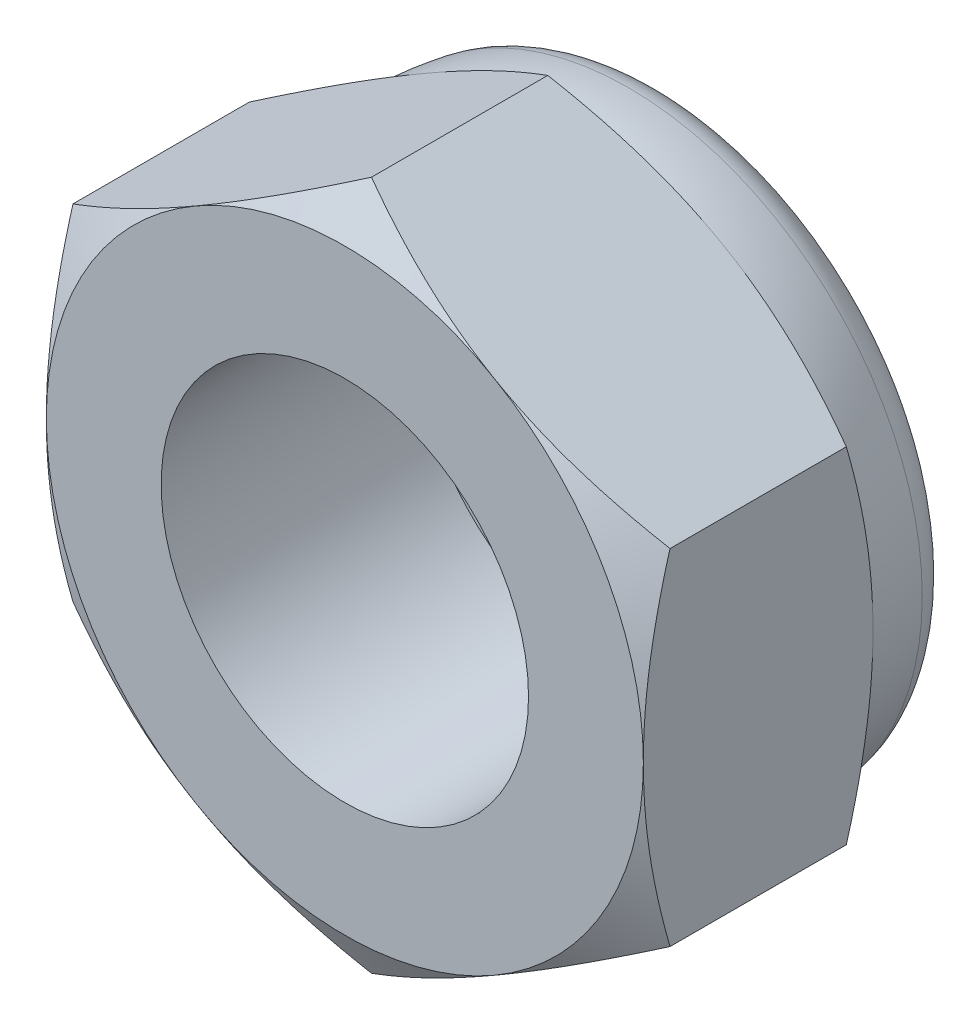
ISO-10303-21;
HEADER;
FILE_DESCRIPTION(('STEP AP214'),'2;1');
FILE_NAME('part.step','',(''),(''),'','','');
FILE_SCHEMA(('AUTOMOTIVE_DESIGN { 1 0 10303 214 1 1 1 1 }'));
ENDSEC;
DATA;
#1=APPLICATION_CONTEXT('core data for automotive mechanical design processes');
#2=APPLICATION_PROTOCOL_DEFINITION('international standard','automotive_design',2000,#1);
#3=PRODUCT_CONTEXT('',#1,'mechanical');
#4=PRODUCT('Part','Part','',(#3));
#5=PRODUCT_RELATED_PRODUCT_CATEGORY('part','',(#4));
#6=PRODUCT_DEFINITION_FORMATION('','',#4);
#7=PRODUCT_DEFINITION_CONTEXT('part definition',#1,'design');
#8=PRODUCT_DEFINITION('design','',#6,#7);
#9=PRODUCT_DEFINITION_SHAPE('','',#8);
#10=(LENGTH_UNIT() NAMED_UNIT(*) SI_UNIT(.MILLI.,.METRE.));
#11=(NAMED_UNIT(*) PLANE_ANGLE_UNIT() SI_UNIT($,.RADIAN.));
#12=(NAMED_UNIT(*) SI_UNIT($,.STERADIAN.) SOLID_ANGLE_UNIT());
#13=UNCERTAINTY_MEASURE_WITH_UNIT(LENGTH_MEASURE(1.E-05),#10,'distance_accuracy_value','');
#14=(GEOMETRIC_REPRESENTATION_CONTEXT(3) GLOBAL_UNCERTAINTY_ASSIGNED_CONTEXT((#13)) GLOBAL_UNIT_ASSIGNED_CONTEXT((#10,
#11,#12)) REPRESENTATION_CONTEXT('',''));
#15=CARTESIAN_POINT('',(0.,0.,0.));
#16=DIRECTION('',(0.,0.,1.));
#17=DIRECTION('',(1.,0.,0.));
#18=AXIS2_PLACEMENT_3D('',#15,#16,#17);
#19=CARTESIAN_POINT('',(0.,0.,-7.));
#20=DIRECTION('',(0.,0.,1.));
#21=DIRECTION('',(1.,0.,0.));
#22=AXIS2_PLACEMENT_3D('',#19,#20,#21);
#23=CYLINDRICAL_SURFACE('',#22,4.);
#24=CARTESIAN_POINT('',(0.,0.,0.));
#25=DIRECTION('',(0.,0.,1.));
#26=DIRECTION('',(1.,0.,0.));
#27=AXIS2_PLACEMENT_3D('',#24,#25,#26);
#28=CIRCLE('',#27,4.);
#29=CARTESIAN_POINT('',(4.,0.,0.));
#30=VERTEX_POINT('',#29);
#31=EDGE_CURVE('E165',#30,#30,#28,.T.);
#32=ORIENTED_EDGE('',*,*,#31,.T.);
#33=EDGE_LOOP('',(#32));
#34=FACE_BOUND('',#33,.T.);
#35=CARTESIAN_POINT('',(0.,0.,-5.6));
#36=DIRECTION('',(0.,0.,-1.));
#37=DIRECTION('',(-1.,0.,0.));
#38=AXIS2_PLACEMENT_3D('',#35,#36,#37);
#39=CIRCLE('',#38,4.);
#40=CARTESIAN_POINT('',(-4.,0.,-5.6));
#41=VERTEX_POINT('',#40);
#42=EDGE_CURVE('E11',#41,#41,#39,.F.);
#43=ORIENTED_EDGE('',*,*,#42,.F.);
#44=EDGE_LOOP('',(#43));
#45=FACE_BOUND('',#44,.T.);
#46=ADVANCED_FACE('F38',(#34,#45),#23,.F.);
#47=CARTESIAN_POINT('',(-6.5,11.2583302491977,0.));
#48=DIRECTION('',(0.,0.,-1.));
#49=DIRECTION('',(-1.,0.,0.));
#50=AXIS2_PLACEMENT_3D('',#47,#48,#49);
#51=PLANE('',#50);
#52=ORIENTED_EDGE('',*,*,#31,.F.);
#53=EDGE_LOOP('',(#52));
#54=FACE_BOUND('',#53,.T.);
#55=CARTESIAN_POINT('',(0.,0.,0.));
#56=DIRECTION('',(0.,0.,-1.));
#57=DIRECTION('',(-1.,0.,0.));
#58=AXIS2_PLACEMENT_3D('',#55,#56,#57);
#59=CIRCLE('',#58,6.5);
#60=CARTESIAN_POINT('',(-6.5,0.,0.));
#61=VERTEX_POINT('',#60);
#62=CARTESIAN_POINT('',(-3.25,5.62916512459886,0.));
#63=VERTEX_POINT('',#62);
#64=EDGE_CURVE('E164',#61,#63,#59,.T.);
#65=ORIENTED_EDGE('',*,*,#64,.F.);
#66=CARTESIAN_POINT('',(0.,0.,0.));
#67=DIRECTION('',(0.,0.,-1.));
#68=DIRECTION('',(-1.,0.,0.));
#69=AXIS2_PLACEMENT_3D('',#66,#67,#68);
#70=CIRCLE('',#69,6.5);
#71=CARTESIAN_POINT('',(-3.25,-5.62916512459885,0.));
#72=VERTEX_POINT('',#71);
#73=EDGE_CURVE('E152',#61,#72,#70,.F.);
#74=ORIENTED_EDGE('',*,*,#73,.T.);
#75=CARTESIAN_POINT('',(3.25,-5.62916512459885,0.));
#76=VERTEX_POINT('',#75);
#77=EDGE_CURVE('E279',#72,#76,#70,.F.);
#78=ORIENTED_EDGE('',*,*,#77,.T.);
#79=CARTESIAN_POINT('',(6.5,0.,0.));
#80=VERTEX_POINT('',#79);
#81=EDGE_CURVE('E577',#76,#80,#70,.F.);
#82=ORIENTED_EDGE('',*,*,#81,.T.);
#83=CARTESIAN_POINT('',(3.25,5.62916512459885,0.));
#84=VERTEX_POINT('',#83);
#85=EDGE_CURVE('E576',#80,#84,#70,.F.);
#86=ORIENTED_EDGE('',*,*,#85,.T.);
#87=EDGE_CURVE('E265',#84,#63,#70,.F.);
#88=ORIENTED_EDGE('',*,*,#87,.T.);
#89=EDGE_LOOP('',(#65,#74,#78,#82,#86,#88));
#90=FACE_BOUND('',#89,.T.);
#91=ADVANCED_FACE('F196',(#54,#90),#51,.F.);
#92=CARTESIAN_POINT('',(0.,0.,0.));
#93=DIRECTION('',(0.,0.,-1.));
#94=DIRECTION('',(-1.,0.,0.));
#95=AXIS2_PLACEMENT_3D('',#92,#93,#94);
#96=CONICAL_SURFACE('',#95,6.5,1.0471975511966);
#97=CARTESIAN_POINT('',(-6.5,-10.2216195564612,-3.24082762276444));
#98=CARTESIAN_POINT('',(-6.5,-9.93651394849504,-3.10196402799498));
#99=CARTESIAN_POINT('',(-6.5,-9.65076884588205,-2.96439164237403));
#100=CARTESIAN_POINT('',(-6.5,-9.07766011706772,-2.69255273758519));
#101=CARTESIAN_POINT('',(-6.5,-8.79029625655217,-2.55828671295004));
#102=CARTESIAN_POINT('',(-6.5,-8.21219637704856,-2.29313832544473));
#103=CARTESIAN_POINT('',(-6.5,-7.92145059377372,-2.16227718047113));
#104=CARTESIAN_POINT('',(-6.5,-7.33769549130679,-1.90572451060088));
#105=CARTESIAN_POINT('',(-6.5,-7.04468627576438,-1.78003275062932));
#106=CARTESIAN_POINT('',(-6.5,-6.44593854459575,-1.53101993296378));
#107=CARTESIAN_POINT('',(-6.5,-6.14010572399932,-1.40792443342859));
#108=CARTESIAN_POINT('',(-6.5,-5.52491418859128,-1.17071249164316));
#109=CARTESIAN_POINT('',(-6.5,-5.2155550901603,-1.05659703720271));
#110=CARTESIAN_POINT('',(-6.5,-4.59335490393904,-0.840237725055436));
#111=CARTESIAN_POINT('',(-6.5,-4.28052184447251,-0.737971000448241));
#112=CARTESIAN_POINT('',(-6.5,-3.65036651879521,-0.548498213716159));
#113=CARTESIAN_POINT('',(-6.5,-3.33304565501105,-0.461287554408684));
#114=CARTESIAN_POINT('',(-6.5,-2.69554853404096,-0.306488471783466));
#115=CARTESIAN_POINT('',(-6.5,-2.37539989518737,-0.238788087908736));
#116=CARTESIAN_POINT('',(-6.5,-1.73093127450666,-0.126743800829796));
#117=CARTESIAN_POINT('',(-6.5,-1.40661173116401,-0.0823974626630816));
#118=CARTESIAN_POINT('',(-6.5,-0.920458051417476,-0.0363312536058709));
#119=CARTESIAN_POINT('',(-6.5,-0.759553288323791,-0.0243981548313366));
#120=CARTESIAN_POINT('',(-6.5,-0.437375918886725,-0.00734758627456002));
#121=CARTESIAN_POINT('',(-6.5,-0.27610331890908,-0.0022299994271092));
#122=CARTESIAN_POINT('',(-6.5,0.0465118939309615,0.0010595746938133));
#123=CARTESIAN_POINT('',(-6.5,0.207854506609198,-0.000768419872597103));
#124=CARTESIAN_POINT('',(-6.5,0.530316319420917,-0.0113216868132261));
#125=CARTESIAN_POINT('',(-6.5,0.691435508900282,-0.020047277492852));
#126=CARTESIAN_POINT('',(-6.5,1.07446143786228,-0.0488019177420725));
#127=CARTESIAN_POINT('',(-6.5,1.29614515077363,-0.0718705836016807));
#128=CARTESIAN_POINT('',(-6.5,1.73794833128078,-0.129839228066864));
#129=CARTESIAN_POINT('',(-6.5,1.95806759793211,-0.164740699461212));
#130=CARTESIAN_POINT('',(-6.5,2.61578223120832,-0.285350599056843));
#131=CARTESIAN_POINT('',(-6.5,3.05050755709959,-0.386945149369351));
#132=CARTESIAN_POINT('',(-6.5,3.70072032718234,-0.564152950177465));
#133=CARTESIAN_POINT('',(-6.5,3.91955235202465,-0.628209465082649));
#134=CARTESIAN_POINT('',(-6.5,4.35509395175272,-0.763235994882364));
#135=CARTESIAN_POINT('',(-6.5,4.5718035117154,-0.834206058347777));
#136=CARTESIAN_POINT('',(-6.5,5.00316322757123,-0.981899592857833));
#137=CARTESIAN_POINT('',(-6.5,5.21781397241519,-1.05862135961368));
#138=CARTESIAN_POINT('',(-6.5,5.64531984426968,-1.21688977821));
#139=CARTESIAN_POINT('',(-6.5,5.85817499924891,-1.2984363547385));
#140=CARTESIAN_POINT('',(-6.5,6.38550742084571,-1.50623164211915));
#141=CARTESIAN_POINT('',(-6.5,6.69902199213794,-1.63491982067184));
#142=CARTESIAN_POINT('',(-6.5,7.32314965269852,-1.89917186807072));
#143=CARTESIAN_POINT('',(-6.5,7.63376250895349,-2.03473628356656));
#144=CARTESIAN_POINT('',(-6.5,8.252670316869,-2.31127478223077));
#145=CARTESIAN_POINT('',(-6.5,8.56096457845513,-2.45225040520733));
#146=CARTESIAN_POINT('',(-6.5,9.17556027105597,-2.73844637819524));
#147=CARTESIAN_POINT('',(-6.5,9.48186175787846,-2.88366660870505));
#148=CARTESIAN_POINT('',(-6.5,10.0932253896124,-3.177700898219));
#149=CARTESIAN_POINT('',(-6.5,10.398285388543,-3.32651941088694));
#150=CARTESIAN_POINT('',(-6.5,11.0070399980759,-3.62692607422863));
#151=CARTESIAN_POINT('',(-6.5,11.3107345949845,-3.77851425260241));
#152=CARTESIAN_POINT('',(-6.5,12.2200136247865,-4.23660374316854));
#153=CARTESIAN_POINT('',(-6.5,12.8238971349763,-4.5464804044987));
#154=CARTESIAN_POINT('',(-6.5,13.9729832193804,-5.14362568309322));
#155=CARTESIAN_POINT('',(-6.5,14.518470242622,-5.43034952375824));
#156=CARTESIAN_POINT('',(-6.5,15.6074489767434,-6.00761837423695));
#157=CARTESIAN_POINT('',(-6.5,16.1509405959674,-6.29816355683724));
#158=CARTESIAN_POINT('',(-6.5,17.2348021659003,-6.88128411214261));
#159=CARTESIAN_POINT('',(-6.5,17.7751765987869,-7.17385116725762));
#160=CARTESIAN_POINT('',(-6.5,18.8546634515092,-7.76122204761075));
#161=CARTESIAN_POINT('',(-6.5,19.393775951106,-8.056025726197));
#162=CARTESIAN_POINT('',(-6.5,19.9324319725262,-8.35165555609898));
#163=B_SPLINE_CURVE_WITH_KNOTS('',3,(#97,#98,#99,#100,#101,#102,#103,#104,#105,#106,#107,#108,
#109,#110,#111,#112,#113,#114,#115,#116,#117,#118,#119,#120,#121,#122,#123,#124,#125,#126,#127,
#128,#129,#130,#131,#132,#133,#134,#135,#136,#137,#138,#139,#140,#141,#142,#143,#144,#145,#146,
#147,#148,#149,#150,#151,#152,#153,#154,#155,#156,#157,#158,#159,#160,#161,#162),.UNSPECIFIED.,
.F.,.F.,(4,2,2,2,2,2,2,2,2,2,2,2,2,2,2,2,2,2,2,2,2,2,2,2,2,2,2,2,2,2,2,2,4),(0.,
0.951386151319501,1.90291374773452,2.85938775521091,3.81581821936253,4.8047370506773,
5.79376451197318,6.78085027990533,7.76763411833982,8.74863704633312,9.72953767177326,
10.2134552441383,10.6973645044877,11.1812724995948,11.6652028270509,12.3334704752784,
13.0018224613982,14.3392064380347,15.0231895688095,15.7071775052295,16.3909635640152,
17.0747389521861,18.091318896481,19.1079797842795,20.1249321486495,21.141855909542,
22.1601102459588,23.1783747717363,25.2145576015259,27.0632980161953,28.9121223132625,
30.7555917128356,32.5989412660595),.UNSPECIFIED.);
#164=CARTESIAN_POINT('',(-6.5,3.75277674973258,-0.580556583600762));
#165=VERTEX_POINT('',#164);
#166=EDGE_CURVE('E182',#165,#61,#163,.F.);
#167=ORIENTED_EDGE('',*,*,#166,.T.);
#168=ORIENTED_EDGE('',*,*,#64,.T.);
#169=CARTESIAN_POINT('',(0.0002,7.50566896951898,-0.580623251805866));
#170=CARTESIAN_POINT('',(-0.14267745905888,7.4231786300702,-0.533004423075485));
#171=CARTESIAN_POINT('',(-0.286087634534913,7.34038072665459,-0.487546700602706));
#172=CARTESIAN_POINT('',(-0.574072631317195,7.17411251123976,-0.401548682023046));
#173=CARTESIAN_POINT('',(-0.718647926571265,7.09064192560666,-0.361010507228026));
#174=CARTESIAN_POINT('',(-1.15468865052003,6.83889369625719,-0.247571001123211));
#175=CARTESIAN_POINT('',(-1.44787528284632,6.66962231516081,-0.183047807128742));
#176=CARTESIAN_POINT('',(-1.88662374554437,6.41631077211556,-0.107386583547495));
#177=CARTESIAN_POINT('',(-2.03087463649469,6.33302748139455,-0.0858328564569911));
#178=CARTESIAN_POINT('',(-2.32002821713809,6.16608458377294,-0.0496903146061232));
#179=CARTESIAN_POINT('',(-2.46493084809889,6.08242501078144,-0.035100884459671));
#180=CARTESIAN_POINT('',(-2.75498777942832,5.91496056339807,-0.0132587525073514));
#181=CARTESIAN_POINT('',(-2.90014160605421,5.83115596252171,-0.00599772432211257));
#182=CARTESIAN_POINT('',(-3.19057533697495,5.66347396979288,0.00103969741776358));
#183=CARTESIAN_POINT('',(-3.33585523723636,5.57959658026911,0.000816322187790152));
#184=CARTESIAN_POINT('',(-3.73387594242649,5.34979921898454,-0.0100834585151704));
#185=CARTESIAN_POINT('',(-3.98648646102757,5.20395446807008,-0.0283818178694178));
#186=CARTESIAN_POINT('',(-4.49002967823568,4.91323365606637,-0.0864063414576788));
#187=CARTESIAN_POINT('',(-4.74096060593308,4.76835861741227,-0.126152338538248));
#188=CARTESIAN_POINT('',(-5.24551722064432,4.47705272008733,-0.225505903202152));
#189=CARTESIAN_POINT('',(-5.49907924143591,4.33065861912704,-0.285534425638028));
#190=CARTESIAN_POINT('',(-6.00242193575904,4.04005357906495,-0.421774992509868));
#191=CARTESIAN_POINT('',(-6.25220905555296,3.89583891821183,-0.497955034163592));
#192=CARTESIAN_POINT('',(-6.5002,3.75266127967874,-0.580623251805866));
#193=B_SPLINE_CURVE_WITH_KNOTS('',3,(#169,#170,#171,#172,#173,#174,#175,#176,#177,#178,#179,
#180,#181,#182,#183,#184,#185,#186,#187,#188,#189,#190,#191,#192),.UNSPECIFIED.,.F.,.F.,(4,2,2,
2,2,2,2,2,2,2,2,4),(0.,0.515105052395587,1.03043143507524,2.06322554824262,2.56697389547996,
3.07067772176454,3.57380860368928,4.0769239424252,4.9527935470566,5.82947446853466,
6.72559912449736,7.61996451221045),.UNSPECIFIED.);
#194=EDGE_CURVE('E168',#63,#165,#193,.T.);
#195=ORIENTED_EDGE('',*,*,#194,.T.);
#196=EDGE_LOOP('',(#167,#168,#195));
#197=FACE_BOUND('',#196,.T.);
#198=ADVANCED_FACE('F190',(#197),#96,.T.);
#199=CARTESIAN_POINT('',(6.5002,3.75266127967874,-0.580623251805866));
#200=CARTESIAN_POINT('',(6.35732254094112,3.83515161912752,-0.533004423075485));
#201=CARTESIAN_POINT('',(6.21391236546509,3.91794952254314,-0.487546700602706));
#202=CARTESIAN_POINT('',(5.9259273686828,4.08421773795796,-0.401548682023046));
#203=CARTESIAN_POINT('',(5.78135207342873,4.16768832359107,-0.361010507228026));
#204=CARTESIAN_POINT('',(5.34531134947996,4.41943655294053,-0.247571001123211));
#205=CARTESIAN_POINT('',(5.05212471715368,4.58870793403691,-0.183047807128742));
#206=CARTESIAN_POINT('',(4.61337625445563,4.84201947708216,-0.107386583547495));
#207=CARTESIAN_POINT('',(4.46912536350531,4.92530276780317,-0.085832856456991));
#208=CARTESIAN_POINT('',(4.17997178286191,5.09224566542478,-0.0496903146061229));
#209=CARTESIAN_POINT('',(4.03506915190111,5.17590523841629,-0.0351008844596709));
#210=CARTESIAN_POINT('',(3.74501222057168,5.34336968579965,-0.0132587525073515));
#211=CARTESIAN_POINT('',(3.59985839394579,5.42717428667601,-0.00599772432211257));
#212=CARTESIAN_POINT('',(3.30942466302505,5.59485627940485,0.00103969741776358));
#213=CARTESIAN_POINT('',(3.16414476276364,5.67873366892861,0.000816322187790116));
#214=CARTESIAN_POINT('',(2.7661240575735,5.90853103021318,-0.0100834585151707));
#215=CARTESIAN_POINT('',(2.51351353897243,6.05437578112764,-0.0283818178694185));
#216=CARTESIAN_POINT('',(2.00997032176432,6.34509659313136,-0.0864063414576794));
#217=CARTESIAN_POINT('',(1.75903939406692,6.48997163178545,-0.126152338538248));
#218=CARTESIAN_POINT('',(1.25448277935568,6.78127752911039,-0.225505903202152));
#219=CARTESIAN_POINT('',(1.00092075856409,6.92767163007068,-0.285534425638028));
#220=CARTESIAN_POINT('',(0.497578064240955,7.21827667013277,-0.421774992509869));
#221=CARTESIAN_POINT('',(0.247790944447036,7.36249133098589,-0.497955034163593));
#222=CARTESIAN_POINT('',(-0.0001999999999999,7.50566896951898,-0.580623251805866));
#223=B_SPLINE_CURVE_WITH_KNOTS('',3,(#199,#200,#201,#202,#203,#204,#205,#206,#207,#208,#209,
#210,#211,#212,#213,#214,#215,#216,#217,#218,#219,#220,#221,#222),.UNSPECIFIED.,.F.,.F.,(4,2,2,
2,2,2,2,2,2,2,2,4),(0.,0.515105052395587,1.03043143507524,2.06322554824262,2.56697389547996,
3.07067772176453,3.57380860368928,4.0769239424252,4.9527935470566,5.82947446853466,
6.72559912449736,7.61996451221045),.UNSPECIFIED.);
#224=CARTESIAN_POINT('',(0.,7.50555349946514,-0.580556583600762));
#225=VERTEX_POINT('',#224);
#226=EDGE_CURVE('E208',#84,#225,#223,.T.);
#227=ORIENTED_EDGE('',*,*,#226,.T.);
#228=EDGE_CURVE('E181',#225,#63,#193,.T.);
#229=ORIENTED_EDGE('',*,*,#228,.T.);
#230=ORIENTED_EDGE('',*,*,#87,.F.);
#231=EDGE_LOOP('',(#227,#229,#230));
#232=FACE_BOUND('',#231,.T.);
#233=ADVANCED_FACE('F195',(#232),#96,.T.);
#234=CARTESIAN_POINT('',(6.5,-10.2216195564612,-3.24082762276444));
#235=CARTESIAN_POINT('',(6.5,-9.93651394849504,-3.10196402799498));
#236=CARTESIAN_POINT('',(6.5,-9.65076884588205,-2.96439164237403));
#237=CARTESIAN_POINT('',(6.5,-9.07766011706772,-2.69255273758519));
#238=CARTESIAN_POINT('',(6.5,-8.79029625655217,-2.55828671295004));
#239=CARTESIAN_POINT('',(6.5,-8.21219637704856,-2.29313832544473));
#240=CARTESIAN_POINT('',(6.5,-7.92145059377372,-2.16227718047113));
#241=CARTESIAN_POINT('',(6.5,-7.33769549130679,-1.90572451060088));
#242=CARTESIAN_POINT('',(6.5,-7.04468627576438,-1.78003275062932));
#243=CARTESIAN_POINT('',(6.5,-6.44593854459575,-1.53101993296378));
#244=CARTESIAN_POINT('',(6.5,-6.14010572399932,-1.40792443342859));
#245=CARTESIAN_POINT('',(6.5,-5.52491418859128,-1.17071249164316));
#246=CARTESIAN_POINT('',(6.5,-5.2155550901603,-1.05659703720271));
#247=CARTESIAN_POINT('',(6.5,-4.59335490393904,-0.840237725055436));
#248=CARTESIAN_POINT('',(6.5,-4.28052184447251,-0.737971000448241));
#249=CARTESIAN_POINT('',(6.5,-3.65036651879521,-0.548498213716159));
#250=CARTESIAN_POINT('',(6.5,-3.33304565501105,-0.461287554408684));
#251=CARTESIAN_POINT('',(6.5,-2.69554853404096,-0.306488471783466));
#252=CARTESIAN_POINT('',(6.5,-2.37539989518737,-0.238788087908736));
#253=CARTESIAN_POINT('',(6.5,-1.73093127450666,-0.126743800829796));
#254=CARTESIAN_POINT('',(6.5,-1.40661173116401,-0.0823974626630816));
#255=CARTESIAN_POINT('',(6.5,-0.920458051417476,-0.0363312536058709));
#256=CARTESIAN_POINT('',(6.5,-0.759553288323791,-0.0243981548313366));
#257=CARTESIAN_POINT('',(6.5,-0.437375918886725,-0.00734758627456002));
#258=CARTESIAN_POINT('',(6.5,-0.27610331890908,-0.0022299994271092));
#259=CARTESIAN_POINT('',(6.5,0.0465118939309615,0.0010595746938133));
#260=CARTESIAN_POINT('',(6.5,0.207854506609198,-0.000768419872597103));
#261=CARTESIAN_POINT('',(6.5,0.530316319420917,-0.0113216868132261));
#262=CARTESIAN_POINT('',(6.5,0.691435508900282,-0.020047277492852));
#263=CARTESIAN_POINT('',(6.5,1.07446143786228,-0.0488019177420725));
#264=CARTESIAN_POINT('',(6.5,1.29614515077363,-0.0718705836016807));
#265=CARTESIAN_POINT('',(6.5,1.73794833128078,-0.129839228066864));
#266=CARTESIAN_POINT('',(6.5,1.95806759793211,-0.164740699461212));
#267=CARTESIAN_POINT('',(6.5,2.61578223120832,-0.285350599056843));
#268=CARTESIAN_POINT('',(6.5,3.05050755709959,-0.386945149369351));
#269=CARTESIAN_POINT('',(6.5,3.70072032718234,-0.564152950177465));
#270=CARTESIAN_POINT('',(6.5,3.91955235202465,-0.628209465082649));
#271=CARTESIAN_POINT('',(6.5,4.35509395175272,-0.763235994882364));
#272=CARTESIAN_POINT('',(6.5,4.5718035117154,-0.834206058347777));
#273=CARTESIAN_POINT('',(6.5,5.00316322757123,-0.981899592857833));
#274=CARTESIAN_POINT('',(6.5,5.21781397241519,-1.05862135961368));
#275=CARTESIAN_POINT('',(6.5,5.64531984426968,-1.21688977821));
#276=CARTESIAN_POINT('',(6.5,5.85817499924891,-1.2984363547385));
#277=CARTESIAN_POINT('',(6.5,6.38550742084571,-1.50623164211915));
#278=CARTESIAN_POINT('',(6.5,6.69902199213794,-1.63491982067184));
#279=CARTESIAN_POINT('',(6.5,7.32314965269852,-1.89917186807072));
#280=CARTESIAN_POINT('',(6.5,7.63376250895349,-2.03473628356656));
#281=CARTESIAN_POINT('',(6.5,8.252670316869,-2.31127478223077));
#282=CARTESIAN_POINT('',(6.5,8.56096457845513,-2.45225040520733));
#283=CARTESIAN_POINT('',(6.5,9.17556027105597,-2.73844637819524));
#284=CARTESIAN_POINT('',(6.5,9.48186175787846,-2.88366660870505));
#285=CARTESIAN_POINT('',(6.5,10.0932253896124,-3.177700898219));
#286=CARTESIAN_POINT('',(6.5,10.398285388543,-3.32651941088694));
#287=CARTESIAN_POINT('',(6.5,11.0070399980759,-3.62692607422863));
#288=CARTESIAN_POINT('',(6.5,11.3107345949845,-3.77851425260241));
#289=CARTESIAN_POINT('',(6.5,12.2200136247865,-4.23660374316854));
#290=CARTESIAN_POINT('',(6.5,12.8238971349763,-4.5464804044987));
#291=CARTESIAN_POINT('',(6.5,13.9729832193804,-5.14362568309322));
#292=CARTESIAN_POINT('',(6.5,14.518470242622,-5.43034952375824));
#293=CARTESIAN_POINT('',(6.5,15.6074489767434,-6.00761837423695));
#294=CARTESIAN_POINT('',(6.5,16.1509405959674,-6.29816355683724));
#295=CARTESIAN_POINT('',(6.5,17.2348021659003,-6.88128411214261));
#296=CARTESIAN_POINT('',(6.5,17.7751765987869,-7.17385116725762));
#297=CARTESIAN_POINT('',(6.5,18.8546634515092,-7.76122204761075));
#298=CARTESIAN_POINT('',(6.5,19.393775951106,-8.056025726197));
#299=CARTESIAN_POINT('',(6.5,19.9324319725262,-8.35165555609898));
#300=B_SPLINE_CURVE_WITH_KNOTS('',3,(#234,#235,#236,#237,#238,#239,#240,#241,#242,#243,#244,
#245,#246,#247,#248,#249,#250,#251,#252,#253,#254,#255,#256,#257,#258,#259,#260,#261,#262,#263,
#264,#265,#266,#267,#268,#269,#270,#271,#272,#273,#274,#275,#276,#277,#278,#279,#280,#281,#282,
#283,#284,#285,#286,#287,#288,#289,#290,#291,#292,#293,#294,#295,#296,#297,#298,#299),
.UNSPECIFIED.,.F.,.F.,(4,2,2,2,2,2,2,2,2,2,2,2,2,2,2,2,2,2,2,2,2,2,2,2,2,2,2,2,2,2,2,2,4),(0.,
0.951386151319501,1.90291374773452,2.85938775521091,3.81581821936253,4.8047370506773,
5.79376451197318,6.78085027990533,7.76763411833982,8.74863704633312,9.72953767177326,
10.2134552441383,10.6973645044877,11.1812724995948,11.6652028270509,12.3334704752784,
13.0018224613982,14.3392064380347,15.0231895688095,15.7071775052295,16.3909635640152,
17.0747389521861,18.091318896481,19.1079797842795,20.1249321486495,21.141855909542,
22.1601102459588,23.1783747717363,25.2145576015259,27.0632980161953,28.9121223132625,
30.7555917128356,32.5989412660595),.UNSPECIFIED.);
#301=CARTESIAN_POINT('',(6.5,3.75277674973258,-0.580556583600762));
#302=VERTEX_POINT('',#301);
#303=EDGE_CURVE('E221',#80,#302,#300,.T.);
#304=ORIENTED_EDGE('',*,*,#303,.T.);
#305=EDGE_CURVE('E543',#302,#84,#223,.T.);
#306=ORIENTED_EDGE('',*,*,#305,.T.);
#307=ORIENTED_EDGE('',*,*,#85,.F.);
#308=EDGE_LOOP('',(#304,#306,#307));
#309=FACE_BOUND('',#308,.T.);
#310=ADVANCED_FACE('F406',(#309),#96,.T.);
#311=CARTESIAN_POINT('',(-0.0002,-7.50566896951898,-0.580623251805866));
#312=CARTESIAN_POINT('',(0.14267745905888,-7.4231786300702,-0.533004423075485));
#313=CARTESIAN_POINT('',(0.286087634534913,-7.34038072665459,-0.487546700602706));
#314=CARTESIAN_POINT('',(0.574072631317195,-7.17411251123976,-0.401548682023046));
#315=CARTESIAN_POINT('',(0.718647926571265,-7.09064192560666,-0.361010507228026));
#316=CARTESIAN_POINT('',(1.15468865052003,-6.83889369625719,-0.247571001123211));
#317=CARTESIAN_POINT('',(1.44787528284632,-6.66962231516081,-0.183047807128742));
#318=CARTESIAN_POINT('',(1.88662374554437,-6.41631077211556,-0.107386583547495));
#319=CARTESIAN_POINT('',(2.03087463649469,-6.33302748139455,-0.0858328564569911));
#320=CARTESIAN_POINT('',(2.32002821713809,-6.16608458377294,-0.0496903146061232));
#321=CARTESIAN_POINT('',(2.46493084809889,-6.08242501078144,-0.035100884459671));
#322=CARTESIAN_POINT('',(2.75498777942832,-5.91496056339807,-0.0132587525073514));
#323=CARTESIAN_POINT('',(2.90014160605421,-5.83115596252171,-0.00599772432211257));
#324=CARTESIAN_POINT('',(3.19057533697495,-5.66347396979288,0.00103969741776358));
#325=CARTESIAN_POINT('',(3.33585523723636,-5.57959658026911,0.000816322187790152));
#326=CARTESIAN_POINT('',(3.73387594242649,-5.34979921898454,-0.0100834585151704));
#327=CARTESIAN_POINT('',(3.98648646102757,-5.20395446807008,-0.0283818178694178));
#328=CARTESIAN_POINT('',(4.49002967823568,-4.91323365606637,-0.0864063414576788));
#329=CARTESIAN_POINT('',(4.74096060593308,-4.76835861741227,-0.126152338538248));
#330=CARTESIAN_POINT('',(5.24551722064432,-4.47705272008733,-0.225505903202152));
#331=CARTESIAN_POINT('',(5.49907924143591,-4.33065861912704,-0.285534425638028));
#332=CARTESIAN_POINT('',(6.00242193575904,-4.04005357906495,-0.421774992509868));
#333=CARTESIAN_POINT('',(6.25220905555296,-3.89583891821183,-0.497955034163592));
#334=CARTESIAN_POINT('',(6.5002,-3.75266127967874,-0.580623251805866));
#335=B_SPLINE_CURVE_WITH_KNOTS('',3,(#311,#312,#313,#314,#315,#316,#317,#318,#319,#320,#321,
#322,#323,#324,#325,#326,#327,#328,#329,#330,#331,#332,#333,#334),.UNSPECIFIED.,.F.,.F.,(4,2,2,
2,2,2,2,2,2,2,2,4),(0.,0.515105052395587,1.03043143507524,2.06322554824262,2.56697389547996,
3.07067772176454,3.57380860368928,4.0769239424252,4.9527935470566,5.82947446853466,
6.72559912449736,7.61996451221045),.UNSPECIFIED.);
#336=CARTESIAN_POINT('',(6.5,-3.75277674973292,-0.580556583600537));
#337=VERTEX_POINT('',#336);
#338=EDGE_CURVE('E228',#76,#337,#335,.T.);
#339=ORIENTED_EDGE('',*,*,#338,.T.);
#340=EDGE_CURVE('E227',#337,#80,#300,.T.);
#341=ORIENTED_EDGE('',*,*,#340,.T.);
#342=ORIENTED_EDGE('',*,*,#81,.F.);
#343=EDGE_LOOP('',(#339,#341,#342));
#344=FACE_BOUND('',#343,.T.);
#345=ADVANCED_FACE('F414',(#344),#96,.T.);
#346=CARTESIAN_POINT('',(0.,-7.50555349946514,-0.580556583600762));
#347=VERTEX_POINT('',#346);
#348=EDGE_CURVE('E141',#347,#76,#335,.T.);
#349=ORIENTED_EDGE('',*,*,#348,.T.);
#350=ORIENTED_EDGE('',*,*,#77,.F.);
#351=CARTESIAN_POINT('',(-6.5002,-3.75266127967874,-0.580623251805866));
#352=CARTESIAN_POINT('',(-6.35732254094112,-3.83515161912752,-0.533004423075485));
#353=CARTESIAN_POINT('',(-6.21391236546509,-3.91794952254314,-0.487546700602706));
#354=CARTESIAN_POINT('',(-5.9259273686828,-4.08421773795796,-0.401548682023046));
#355=CARTESIAN_POINT('',(-5.78135207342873,-4.16768832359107,-0.361010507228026));
#356=CARTESIAN_POINT('',(-5.34531134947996,-4.41943655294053,-0.247571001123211));
#357=CARTESIAN_POINT('',(-5.05212471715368,-4.58870793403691,-0.183047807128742));
#358=CARTESIAN_POINT('',(-4.61337625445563,-4.84201947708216,-0.107386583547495));
#359=CARTESIAN_POINT('',(-4.46912536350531,-4.92530276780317,-0.085832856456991));
#360=CARTESIAN_POINT('',(-4.17997178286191,-5.09224566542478,-0.0496903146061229));
#361=CARTESIAN_POINT('',(-4.03506915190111,-5.17590523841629,-0.0351008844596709));
#362=CARTESIAN_POINT('',(-3.74501222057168,-5.34336968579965,-0.0132587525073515));
#363=CARTESIAN_POINT('',(-3.59985839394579,-5.42717428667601,-0.00599772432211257));
#364=CARTESIAN_POINT('',(-3.30942466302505,-5.59485627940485,0.00103969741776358));
#365=CARTESIAN_POINT('',(-3.16414476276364,-5.67873366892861,0.000816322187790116));
#366=CARTESIAN_POINT('',(-2.7661240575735,-5.90853103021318,-0.0100834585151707));
#367=CARTESIAN_POINT('',(-2.51351353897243,-6.05437578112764,-0.0283818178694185));
#368=CARTESIAN_POINT('',(-2.00997032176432,-6.34509659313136,-0.0864063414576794));
#369=CARTESIAN_POINT('',(-1.75903939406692,-6.48997163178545,-0.126152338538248));
#370=CARTESIAN_POINT('',(-1.25448277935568,-6.78127752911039,-0.225505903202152));
#371=CARTESIAN_POINT('',(-1.00092075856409,-6.92767163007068,-0.285534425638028));
#372=CARTESIAN_POINT('',(-0.497578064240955,-7.21827667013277,-0.421774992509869));
#373=CARTESIAN_POINT('',(-0.247790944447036,-7.36249133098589,-0.497955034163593));
#374=CARTESIAN_POINT('',(0.0001999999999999,-7.50566896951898,-0.580623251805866));
#375=B_SPLINE_CURVE_WITH_KNOTS('',3,(#351,#352,#353,#354,#355,#356,#357,#358,#359,#360,#361,
#362,#363,#364,#365,#366,#367,#368,#369,#370,#371,#372,#373,#374),.UNSPECIFIED.,.F.,.F.,(4,2,2,
2,2,2,2,2,2,2,2,4),(0.,0.515105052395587,1.03043143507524,2.06322554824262,2.56697389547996,
3.07067772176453,3.57380860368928,4.0769239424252,4.9527935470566,5.82947446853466,
6.72559912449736,7.61996451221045),.UNSPECIFIED.);
#376=EDGE_CURVE('E539',#72,#347,#375,.T.);
#377=ORIENTED_EDGE('',*,*,#376,.T.);
#378=EDGE_LOOP('',(#349,#350,#377));
#379=FACE_BOUND('',#378,.T.);
#380=ADVANCED_FACE('F198',(#379),#96,.T.);
#381=CARTESIAN_POINT('',(-6.5,-3.75277674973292,-0.580556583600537));
#382=VERTEX_POINT('',#381);
#383=EDGE_CURVE('E214',#382,#72,#375,.T.);
#384=ORIENTED_EDGE('',*,*,#383,.T.);
#385=ORIENTED_EDGE('',*,*,#73,.F.);
#386=EDGE_CURVE('E541',#61,#382,#163,.F.);
#387=ORIENTED_EDGE('',*,*,#386,.T.);
#388=EDGE_LOOP('',(#384,#385,#387));
#389=FACE_BOUND('',#388,.T.);
#390=ADVANCED_FACE('F408',(#389),#96,.T.);
#391=CARTESIAN_POINT('',(6.5,3.75277674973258,-5.));
#392=DIRECTION('',(0.499999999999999,0.866025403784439,0.));
#393=DIRECTION('',(-0.866025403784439,0.499999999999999,0.));
#394=AXIS2_PLACEMENT_3D('',#391,#392,#393);
#395=PLANE('',#394);
#396=CARTESIAN_POINT('',(-0.0002,7.50566896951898,-4.41937674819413));
#397=CARTESIAN_POINT('',(0.14267745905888,7.4231786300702,-4.46699557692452));
#398=CARTESIAN_POINT('',(0.286087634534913,7.34038072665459,-4.51245329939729));
#399=CARTESIAN_POINT('',(0.574072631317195,7.17411251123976,-4.59845131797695));
#400=CARTESIAN_POINT('',(0.718647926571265,7.09064192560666,-4.63898949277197));
#401=CARTESIAN_POINT('',(1.15468865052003,6.83889369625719,-4.75242899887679));
#402=CARTESIAN_POINT('',(1.44787528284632,6.66962231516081,-4.81695219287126));
#403=CARTESIAN_POINT('',(1.88662374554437,6.41631077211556,-4.89261341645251));
#404=CARTESIAN_POINT('',(2.03087463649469,6.33302748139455,-4.91416714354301));
#405=CARTESIAN_POINT('',(2.32002821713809,6.16608458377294,-4.95030968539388));
#406=CARTESIAN_POINT('',(2.46493084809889,6.08242501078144,-4.96489911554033));
#407=CARTESIAN_POINT('',(2.75498777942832,5.91496056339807,-4.98674124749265));
#408=CARTESIAN_POINT('',(2.90014160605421,5.83115596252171,-4.99400227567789));
#409=CARTESIAN_POINT('',(3.19057533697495,5.66347396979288,-5.00103969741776));
#410=CARTESIAN_POINT('',(3.33585523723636,5.57959658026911,-5.00081632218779));
#411=CARTESIAN_POINT('',(3.73387594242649,5.34979921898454,-4.98991654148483));
#412=CARTESIAN_POINT('',(3.98648646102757,5.20395446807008,-4.97161818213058));
#413=CARTESIAN_POINT('',(4.49002967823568,4.91323365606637,-4.91359365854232));
#414=CARTESIAN_POINT('',(4.74096060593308,4.76835861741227,-4.87384766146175));
#415=CARTESIAN_POINT('',(5.24551722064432,4.47705272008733,-4.77449409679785));
#416=CARTESIAN_POINT('',(5.49907924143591,4.33065861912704,-4.71446557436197));
#417=CARTESIAN_POINT('',(6.00242193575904,4.04005357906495,-4.57822500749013));
#418=CARTESIAN_POINT('',(6.25220905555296,3.89583891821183,-4.50204496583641));
#419=CARTESIAN_POINT('',(6.5002,3.75266127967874,-4.41937674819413));
#420=B_SPLINE_CURVE_WITH_KNOTS('',3,(#396,#397,#398,#399,#400,#401,#402,#403,#404,#405,#406,
#407,#408,#409,#410,#411,#412,#413,#414,#415,#416,#417,#418,#419),.UNSPECIFIED.,.F.,.F.,(4,2,2,
2,2,2,2,2,2,2,2,4),(0.,0.515105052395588,1.03043143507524,2.06322554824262,2.56697389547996,
3.07067772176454,3.57380860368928,4.0769239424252,4.9527935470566,5.82947446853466,
6.72559912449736,7.61996451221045),.UNSPECIFIED.);
#421=CARTESIAN_POINT('',(0.,7.50555349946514,-4.41944341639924));
#422=VERTEX_POINT('',#421);
#423=CARTESIAN_POINT('',(3.25,5.62916512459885,-5.));
#424=VERTEX_POINT('',#423);
#425=EDGE_CURVE('E146',#422,#424,#420,.T.);
#426=ORIENTED_EDGE('',*,*,#425,.F.);
#427=DIRECTION('',(0.,0.,1.));
#428=VECTOR('',#427,1.);
#429=CARTESIAN_POINT('',(0.,7.50555349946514,-5.));
#430=LINE('',#429,#428);
#431=EDGE_CURVE('E138',#422,#225,#430,.T.);
#432=ORIENTED_EDGE('',*,*,#431,.T.);
#433=ORIENTED_EDGE('',*,*,#226,.F.);
#434=ORIENTED_EDGE('',*,*,#305,.F.);
#435=DIRECTION('',(0.,0.,1.));
#436=VECTOR('',#435,1.);
#437=CARTESIAN_POINT('',(6.5,3.75277674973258,-5.));
#438=LINE('',#437,#436);
#439=CARTESIAN_POINT('',(6.5,3.75277674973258,-4.41944341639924));
#440=VERTEX_POINT('',#439);
#441=EDGE_CURVE('E262',#440,#302,#438,.T.);
#442=ORIENTED_EDGE('',*,*,#441,.F.);
#443=EDGE_CURVE('E256',#424,#440,#420,.T.);
#444=ORIENTED_EDGE('',*,*,#443,.F.);
#445=EDGE_LOOP('',(#426,#432,#433,#434,#442,#444));
#446=FACE_BOUND('',#445,.T.);
#447=ADVANCED_FACE('F40',(#446),#395,.T.);
#448=CARTESIAN_POINT('',(6.5,-3.75277674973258,-5.));
#449=DIRECTION('',(1.,0.,0.));
#450=DIRECTION('',(0.,0.,-1.));
#451=AXIS2_PLACEMENT_3D('',#448,#449,#450);
#452=PLANE('',#451);
#453=CARTESIAN_POINT('',(6.5,-10.2216195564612,-1.75917237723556));
#454=CARTESIAN_POINT('',(6.5,-9.93651394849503,-1.89803597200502));
#455=CARTESIAN_POINT('',(6.5,-9.65076884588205,-2.03560835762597));
#456=CARTESIAN_POINT('',(6.5,-9.07766011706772,-2.30744726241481));
#457=CARTESIAN_POINT('',(6.5,-8.79029625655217,-2.44171328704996));
#458=CARTESIAN_POINT('',(6.5,-8.21219637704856,-2.70686167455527));
#459=CARTESIAN_POINT('',(6.5,-7.92145059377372,-2.83772281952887));
#460=CARTESIAN_POINT('',(6.5,-7.33769549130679,-3.09427548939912));
#461=CARTESIAN_POINT('',(6.5,-7.04468627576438,-3.21996724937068));
#462=CARTESIAN_POINT('',(6.5,-6.44593854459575,-3.46898006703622));
#463=CARTESIAN_POINT('',(6.5,-6.14010572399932,-3.59207556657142));
#464=CARTESIAN_POINT('',(6.5,-5.52491418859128,-3.82928750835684));
#465=CARTESIAN_POINT('',(6.5,-5.2155550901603,-3.9434029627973));
#466=CARTESIAN_POINT('',(6.5,-4.59335490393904,-4.15976227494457));
#467=CARTESIAN_POINT('',(6.5,-4.28052184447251,-4.26202899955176));
#468=CARTESIAN_POINT('',(6.5,-3.65036651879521,-4.45150178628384));
#469=CARTESIAN_POINT('',(6.5,-3.33304565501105,-4.53871244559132));
#470=CARTESIAN_POINT('',(6.5,-2.69554853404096,-4.69351152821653));
#471=CARTESIAN_POINT('',(6.5,-2.37539989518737,-4.76121191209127));
#472=CARTESIAN_POINT('',(6.5,-1.73093127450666,-4.87325619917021));
#473=CARTESIAN_POINT('',(6.5,-1.40661173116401,-4.91760253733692));
#474=CARTESIAN_POINT('',(6.5,-0.920458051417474,-4.96366874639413));
#475=CARTESIAN_POINT('',(6.5,-0.759553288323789,-4.97560184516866));
#476=CARTESIAN_POINT('',(6.5,-0.437375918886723,-4.99265241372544));
#477=CARTESIAN_POINT('',(6.5,-0.276103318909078,-4.99777000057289));
#478=CARTESIAN_POINT('',(6.5,0.0465118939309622,-5.00105957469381));
#479=CARTESIAN_POINT('',(6.5,0.207854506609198,-4.9992315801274));
#480=CARTESIAN_POINT('',(6.5,0.530316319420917,-4.98867831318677));
#481=CARTESIAN_POINT('',(6.5,0.691435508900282,-4.97995272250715));
#482=CARTESIAN_POINT('',(6.5,1.07446143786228,-4.95119808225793));
#483=CARTESIAN_POINT('',(6.5,1.29614515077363,-4.92812941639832));
#484=CARTESIAN_POINT('',(6.5,1.73794833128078,-4.87016077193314));
#485=CARTESIAN_POINT('',(6.5,1.95806759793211,-4.83525930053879));
#486=CARTESIAN_POINT('',(6.5,2.61578223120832,-4.71464940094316));
#487=CARTESIAN_POINT('',(6.5,3.05050755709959,-4.61305485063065));
#488=CARTESIAN_POINT('',(6.5,3.70072032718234,-4.43584704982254));
#489=CARTESIAN_POINT('',(6.5,3.91955235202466,-4.37179053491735));
#490=CARTESIAN_POINT('',(6.5,4.35509395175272,-4.23676400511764));
#491=CARTESIAN_POINT('',(6.5,4.5718035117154,-4.16579394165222));
#492=CARTESIAN_POINT('',(6.5,5.00316322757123,-4.01810040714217));
#493=CARTESIAN_POINT('',(6.5,5.21781397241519,-3.94137864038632));
#494=CARTESIAN_POINT('',(6.5,5.64531984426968,-3.78311022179));
#495=CARTESIAN_POINT('',(6.5,5.85817499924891,-3.7015636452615));
#496=CARTESIAN_POINT('',(6.5,6.38550742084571,-3.49376835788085));
#497=CARTESIAN_POINT('',(6.5,6.69902199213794,-3.36508017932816));
#498=CARTESIAN_POINT('',(6.5,7.32314965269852,-3.10082813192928));
#499=CARTESIAN_POINT('',(6.5,7.63376250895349,-2.96526371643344));
#500=CARTESIAN_POINT('',(6.5,8.252670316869,-2.68872521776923));
#501=CARTESIAN_POINT('',(6.5,8.56096457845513,-2.54774959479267));
#502=CARTESIAN_POINT('',(6.5,9.17556027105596,-2.26155362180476));
#503=CARTESIAN_POINT('',(6.5,9.48186175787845,-2.11633339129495));
#504=CARTESIAN_POINT('',(6.5,10.0932253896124,-1.822299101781));
#505=CARTESIAN_POINT('',(6.5,10.398285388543,-1.67348058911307));
#506=CARTESIAN_POINT('',(6.5,11.0070399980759,-1.37307392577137));
#507=CARTESIAN_POINT('',(6.5,11.3107345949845,-1.2214857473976));
#508=CARTESIAN_POINT('',(6.5,12.2200136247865,-0.763396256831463));
#509=CARTESIAN_POINT('',(6.5,12.8238971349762,-0.453519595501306));
#510=CARTESIAN_POINT('',(6.5,13.9729832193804,0.143625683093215));
#511=CARTESIAN_POINT('',(6.5,14.518470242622,0.430349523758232));
#512=CARTESIAN_POINT('',(6.5,15.6074489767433,1.00761837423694));
#513=CARTESIAN_POINT('',(6.5,16.1509405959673,1.29816355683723));
#514=CARTESIAN_POINT('',(6.5,17.2348021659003,1.88128411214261));
#515=CARTESIAN_POINT('',(6.5,17.7751765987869,2.17385116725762));
#516=CARTESIAN_POINT('',(6.5,18.8546634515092,2.76122204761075));
#517=CARTESIAN_POINT('',(6.5,19.393775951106,3.056025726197));
#518=CARTESIAN_POINT('',(6.5,19.9324319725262,3.35165555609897));
#519=B_SPLINE_CURVE_WITH_KNOTS('',3,(#453,#454,#455,#456,#457,#458,#459,#460,#461,#462,#463,
#464,#465,#466,#467,#468,#469,#470,#471,#472,#473,#474,#475,#476,#477,#478,#479,#480,#481,#482,
#483,#484,#485,#486,#487,#488,#489,#490,#491,#492,#493,#494,#495,#496,#497,#498,#499,#500,#501,
#502,#503,#504,#505,#506,#507,#508,#509,#510,#511,#512,#513,#514,#515,#516,#517,#518),
.UNSPECIFIED.,.F.,.F.,(4,2,2,2,2,2,2,2,2,2,2,2,2,2,2,2,2,2,2,2,2,2,2,2,2,2,2,2,2,2,2,2,4),(0.,
0.9513861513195,1.90291374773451,2.8593877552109,3.81581821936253,4.8047370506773,
5.79376451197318,6.78085027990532,7.76763411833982,8.74863704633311,9.72953767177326,
10.2134552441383,10.6973645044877,11.1812724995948,11.6652028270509,12.3334704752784,
13.0018224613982,14.3392064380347,15.0231895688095,15.7071775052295,16.3909635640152,
17.0747389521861,18.091318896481,19.1079797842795,20.1249321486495,21.141855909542,
22.1601102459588,23.1783747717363,25.2145576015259,27.0632980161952,28.9121223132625,
30.7555917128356,32.5989412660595),.UNSPECIFIED.);
#520=CARTESIAN_POINT('',(6.5,0.,-5.));
#521=VERTEX_POINT('',#520);
#522=EDGE_CURVE('E249',#440,#521,#519,.F.);
#523=ORIENTED_EDGE('',*,*,#522,.F.);
#524=ORIENTED_EDGE('',*,*,#441,.T.);
#525=ORIENTED_EDGE('',*,*,#303,.F.);
#526=ORIENTED_EDGE('',*,*,#340,.F.);
#527=DIRECTION('',(0.,0.,1.));
#528=VECTOR('',#527,1.);
#529=CARTESIAN_POINT('',(6.5,-3.75277674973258,-5.));
#530=LINE('',#529,#528);
#531=CARTESIAN_POINT('',(6.5,-3.75277674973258,-4.41944341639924));
#532=VERTEX_POINT('',#531);
#533=EDGE_CURVE('E266',#532,#337,#530,.T.);
#534=ORIENTED_EDGE('',*,*,#533,.F.);
#535=EDGE_CURVE('E242',#521,#532,#519,.F.);
#536=ORIENTED_EDGE('',*,*,#535,.F.);
#537=EDGE_LOOP('',(#523,#524,#525,#526,#534,#536));
#538=FACE_BOUND('',#537,.T.);
#539=ADVANCED_FACE('F234',(#538),#452,.T.);
#540=CARTESIAN_POINT('',(6.5,-3.75277674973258,-5.));
#541=DIRECTION('',(0.499999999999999,-0.866025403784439,0.));
#542=DIRECTION('',(0.866025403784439,0.499999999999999,0.));
#543=AXIS2_PLACEMENT_3D('',#540,#541,#542);
#544=PLANE('',#543);
#545=CARTESIAN_POINT('',(6.5002,-3.75266127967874,-4.41937674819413));
#546=CARTESIAN_POINT('',(6.35732254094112,-3.83515161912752,-4.46699557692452));
#547=CARTESIAN_POINT('',(6.21391236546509,-3.91794952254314,-4.51245329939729));
#548=CARTESIAN_POINT('',(5.9259273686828,-4.08421773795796,-4.59845131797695));
#549=CARTESIAN_POINT('',(5.78135207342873,-4.16768832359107,-4.63898949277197));
#550=CARTESIAN_POINT('',(5.34531134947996,-4.41943655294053,-4.75242899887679));
#551=CARTESIAN_POINT('',(5.05212471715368,-4.58870793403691,-4.81695219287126));
#552=CARTESIAN_POINT('',(4.61337625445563,-4.84201947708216,-4.89261341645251));
#553=CARTESIAN_POINT('',(4.46912536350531,-4.92530276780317,-4.91416714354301));
#554=CARTESIAN_POINT('',(4.17997178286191,-5.09224566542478,-4.95030968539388));
#555=CARTESIAN_POINT('',(4.03506915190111,-5.17590523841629,-4.96489911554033));
#556=CARTESIAN_POINT('',(3.74501222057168,-5.34336968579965,-4.98674124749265));
#557=CARTESIAN_POINT('',(3.59985839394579,-5.42717428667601,-4.99400227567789));
#558=CARTESIAN_POINT('',(3.30942466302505,-5.59485627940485,-5.00103969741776));
#559=CARTESIAN_POINT('',(3.16414476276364,-5.67873366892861,-5.00081632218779));
#560=CARTESIAN_POINT('',(2.7661240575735,-5.90853103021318,-4.98991654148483));
#561=CARTESIAN_POINT('',(2.51351353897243,-6.05437578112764,-4.97161818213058));
#562=CARTESIAN_POINT('',(2.00997032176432,-6.34509659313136,-4.91359365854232));
#563=CARTESIAN_POINT('',(1.75903939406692,-6.48997163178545,-4.87384766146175));
#564=CARTESIAN_POINT('',(1.25448277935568,-6.78127752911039,-4.77449409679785));
#565=CARTESIAN_POINT('',(1.00092075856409,-6.92767163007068,-4.71446557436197));
#566=CARTESIAN_POINT('',(0.497578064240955,-7.21827667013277,-4.57822500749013));
#567=CARTESIAN_POINT('',(0.247790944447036,-7.36249133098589,-4.50204496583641));
#568=CARTESIAN_POINT('',(-0.000199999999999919,-7.50566896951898,-4.41937674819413));
#569=B_SPLINE_CURVE_WITH_KNOTS('',3,(#545,#546,#547,#548,#549,#550,#551,#552,#553,#554,#555,
#556,#557,#558,#559,#560,#561,#562,#563,#564,#565,#566,#567,#568),.UNSPECIFIED.,.F.,.F.,(4,2,2,
2,2,2,2,2,2,2,2,4),(0.,0.515105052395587,1.03043143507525,2.06322554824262,2.56697389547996,
3.07067772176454,3.57380860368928,4.0769239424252,4.9527935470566,5.82947446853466,
6.72559912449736,7.61996451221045),.UNSPECIFIED.);
#570=CARTESIAN_POINT('',(3.25,-5.62916512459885,-5.));
#571=VERTEX_POINT('',#570);
#572=EDGE_CURVE('E62',#532,#571,#569,.T.);
#573=ORIENTED_EDGE('',*,*,#572,.F.);
#574=ORIENTED_EDGE('',*,*,#533,.T.);
#575=ORIENTED_EDGE('',*,*,#338,.F.);
#576=ORIENTED_EDGE('',*,*,#348,.F.);
#577=DIRECTION('',(0.,0.,1.));
#578=VECTOR('',#577,1.);
#579=CARTESIAN_POINT('',(0.,-7.50555349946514,-5.));
#580=LINE('',#579,#578);
#581=CARTESIAN_POINT('',(0.,-7.50555349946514,-4.41944341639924));
#582=VERTEX_POINT('',#581);
#583=EDGE_CURVE('E269',#582,#347,#580,.T.);
#584=ORIENTED_EDGE('',*,*,#583,.F.);
#585=EDGE_CURVE('E250',#571,#582,#569,.T.);
#586=ORIENTED_EDGE('',*,*,#585,.F.);
#587=EDGE_LOOP('',(#573,#574,#575,#576,#584,#586));
#588=FACE_BOUND('',#587,.T.);
#589=ADVANCED_FACE('F237',(#588),#544,.T.);
#590=CARTESIAN_POINT('',(-6.5,-3.75277674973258,-5.));
#591=DIRECTION('',(-0.499999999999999,-0.866025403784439,0.));
#592=DIRECTION('',(0.866025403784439,-0.499999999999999,0.));
#593=AXIS2_PLACEMENT_3D('',#590,#591,#592);
#594=PLANE('',#593);
#595=CARTESIAN_POINT('',(0.0002,-7.50566896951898,-4.41937674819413));
#596=CARTESIAN_POINT('',(-0.14267745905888,-7.4231786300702,-4.46699557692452));
#597=CARTESIAN_POINT('',(-0.286087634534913,-7.34038072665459,-4.51245329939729));
#598=CARTESIAN_POINT('',(-0.574072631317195,-7.17411251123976,-4.59845131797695));
#599=CARTESIAN_POINT('',(-0.718647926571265,-7.09064192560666,-4.63898949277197));
#600=CARTESIAN_POINT('',(-1.15468865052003,-6.83889369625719,-4.75242899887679));
#601=CARTESIAN_POINT('',(-1.44787528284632,-6.66962231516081,-4.81695219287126));
#602=CARTESIAN_POINT('',(-1.88662374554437,-6.41631077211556,-4.89261341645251));
#603=CARTESIAN_POINT('',(-2.03087463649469,-6.33302748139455,-4.91416714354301));
#604=CARTESIAN_POINT('',(-2.32002821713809,-6.16608458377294,-4.95030968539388));
#605=CARTESIAN_POINT('',(-2.46493084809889,-6.08242501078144,-4.96489911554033));
#606=CARTESIAN_POINT('',(-2.75498777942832,-5.91496056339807,-4.98674124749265));
#607=CARTESIAN_POINT('',(-2.90014160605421,-5.83115596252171,-4.99400227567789));
#608=CARTESIAN_POINT('',(-3.19057533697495,-5.66347396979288,-5.00103969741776));
#609=CARTESIAN_POINT('',(-3.33585523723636,-5.57959658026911,-5.00081632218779));
#610=CARTESIAN_POINT('',(-3.73387594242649,-5.34979921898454,-4.98991654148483));
#611=CARTESIAN_POINT('',(-3.98648646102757,-5.20395446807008,-4.97161818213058));
#612=CARTESIAN_POINT('',(-4.49002967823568,-4.91323365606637,-4.91359365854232));
#613=CARTESIAN_POINT('',(-4.74096060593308,-4.76835861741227,-4.87384766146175));
#614=CARTESIAN_POINT('',(-5.24551722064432,-4.47705272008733,-4.77449409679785));
#615=CARTESIAN_POINT('',(-5.49907924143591,-4.33065861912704,-4.71446557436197));
#616=CARTESIAN_POINT('',(-6.00242193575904,-4.04005357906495,-4.57822500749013));
#617=CARTESIAN_POINT('',(-6.25220905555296,-3.89583891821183,-4.50204496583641));
#618=CARTESIAN_POINT('',(-6.5002,-3.75266127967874,-4.41937674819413));
#619=B_SPLINE_CURVE_WITH_KNOTS('',3,(#595,#596,#597,#598,#599,#600,#601,#602,#603,#604,#605,
#606,#607,#608,#609,#610,#611,#612,#613,#614,#615,#616,#617,#618),.UNSPECIFIED.,.F.,.F.,(4,2,2,
2,2,2,2,2,2,2,2,4),(0.,0.515105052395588,1.03043143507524,2.06322554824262,2.56697389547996,
3.07067772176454,3.57380860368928,4.0769239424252,4.9527935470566,5.82947446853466,
6.72559912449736,7.61996451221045),.UNSPECIFIED.);
#620=CARTESIAN_POINT('',(-3.25,-5.62916512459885,-5.));
#621=VERTEX_POINT('',#620);
#622=EDGE_CURVE('E54',#582,#621,#619,.T.);
#623=ORIENTED_EDGE('',*,*,#622,.F.);
#624=ORIENTED_EDGE('',*,*,#583,.T.);
#625=ORIENTED_EDGE('',*,*,#376,.F.);
#626=ORIENTED_EDGE('',*,*,#383,.F.);
#627=DIRECTION('',(0.,0.,1.));
#628=VECTOR('',#627,1.);
#629=CARTESIAN_POINT('',(-6.5,-3.75277674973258,-5.));
#630=LINE('',#629,#628);
#631=CARTESIAN_POINT('',(-6.5,-3.75277674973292,-4.41944341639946));
#632=VERTEX_POINT('',#631);
#633=EDGE_CURVE('E272',#632,#382,#630,.T.);
#634=ORIENTED_EDGE('',*,*,#633,.F.);
#635=EDGE_CURVE('E534',#621,#632,#619,.T.);
#636=ORIENTED_EDGE('',*,*,#635,.F.);
#637=EDGE_LOOP('',(#623,#624,#625,#626,#634,#636));
#638=FACE_BOUND('',#637,.T.);
#639=ADVANCED_FACE('F450',(#638),#594,.T.);
#640=CARTESIAN_POINT('',(-6.5,-3.75277674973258,-5.));
#641=DIRECTION('',(-1.,0.,0.));
#642=DIRECTION('',(0.,0.,1.));
#643=AXIS2_PLACEMENT_3D('',#640,#641,#642);
#644=PLANE('',#643);
#645=CARTESIAN_POINT('',(-6.5,-10.2216195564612,-1.75917237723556));
#646=CARTESIAN_POINT('',(-6.5,-9.93651394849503,-1.89803597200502));
#647=CARTESIAN_POINT('',(-6.5,-9.65076884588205,-2.03560835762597));
#648=CARTESIAN_POINT('',(-6.5,-9.07766011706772,-2.30744726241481));
#649=CARTESIAN_POINT('',(-6.5,-8.79029625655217,-2.44171328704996));
#650=CARTESIAN_POINT('',(-6.5,-8.21219637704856,-2.70686167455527));
#651=CARTESIAN_POINT('',(-6.5,-7.92145059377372,-2.83772281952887));
#652=CARTESIAN_POINT('',(-6.5,-7.33769549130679,-3.09427548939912));
#653=CARTESIAN_POINT('',(-6.5,-7.04468627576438,-3.21996724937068));
#654=CARTESIAN_POINT('',(-6.5,-6.44593854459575,-3.46898006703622));
#655=CARTESIAN_POINT('',(-6.5,-6.14010572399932,-3.59207556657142));
#656=CARTESIAN_POINT('',(-6.5,-5.52491418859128,-3.82928750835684));
#657=CARTESIAN_POINT('',(-6.5,-5.2155550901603,-3.9434029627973));
#658=CARTESIAN_POINT('',(-6.5,-4.59335490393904,-4.15976227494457));
#659=CARTESIAN_POINT('',(-6.5,-4.28052184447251,-4.26202899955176));
#660=CARTESIAN_POINT('',(-6.5,-3.65036651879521,-4.45150178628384));
#661=CARTESIAN_POINT('',(-6.5,-3.33304565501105,-4.53871244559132));
#662=CARTESIAN_POINT('',(-6.5,-2.69554853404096,-4.69351152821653));
#663=CARTESIAN_POINT('',(-6.5,-2.37539989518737,-4.76121191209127));
#664=CARTESIAN_POINT('',(-6.5,-1.73093127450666,-4.87325619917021));
#665=CARTESIAN_POINT('',(-6.5,-1.40661173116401,-4.91760253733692));
#666=CARTESIAN_POINT('',(-6.5,-0.920458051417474,-4.96366874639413));
#667=CARTESIAN_POINT('',(-6.5,-0.759553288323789,-4.97560184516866));
#668=CARTESIAN_POINT('',(-6.5,-0.437375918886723,-4.99265241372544));
#669=CARTESIAN_POINT('',(-6.5,-0.276103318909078,-4.99777000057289));
#670=CARTESIAN_POINT('',(-6.5,0.0465118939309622,-5.00105957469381));
#671=CARTESIAN_POINT('',(-6.5,0.207854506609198,-4.9992315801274));
#672=CARTESIAN_POINT('',(-6.5,0.530316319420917,-4.98867831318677));
#673=CARTESIAN_POINT('',(-6.5,0.691435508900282,-4.97995272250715));
#674=CARTESIAN_POINT('',(-6.5,1.07446143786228,-4.95119808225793));
#675=CARTESIAN_POINT('',(-6.5,1.29614515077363,-4.92812941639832));
#676=CARTESIAN_POINT('',(-6.5,1.73794833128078,-4.87016077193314));
#677=CARTESIAN_POINT('',(-6.5,1.95806759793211,-4.83525930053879));
#678=CARTESIAN_POINT('',(-6.5,2.61578223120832,-4.71464940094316));
#679=CARTESIAN_POINT('',(-6.5,3.05050755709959,-4.61305485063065));
#680=CARTESIAN_POINT('',(-6.5,3.70072032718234,-4.43584704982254));
#681=CARTESIAN_POINT('',(-6.5,3.91955235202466,-4.37179053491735));
#682=CARTESIAN_POINT('',(-6.5,4.35509395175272,-4.23676400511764));
#683=CARTESIAN_POINT('',(-6.5,4.5718035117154,-4.16579394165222));
#684=CARTESIAN_POINT('',(-6.5,5.00316322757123,-4.01810040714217));
#685=CARTESIAN_POINT('',(-6.5,5.21781397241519,-3.94137864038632));
#686=CARTESIAN_POINT('',(-6.5,5.64531984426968,-3.78311022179));
#687=CARTESIAN_POINT('',(-6.5,5.85817499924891,-3.7015636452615));
#688=CARTESIAN_POINT('',(-6.5,6.38550742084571,-3.49376835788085));
#689=CARTESIAN_POINT('',(-6.5,6.69902199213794,-3.36508017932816));
#690=CARTESIAN_POINT('',(-6.5,7.32314965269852,-3.10082813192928));
#691=CARTESIAN_POINT('',(-6.5,7.63376250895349,-2.96526371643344));
#692=CARTESIAN_POINT('',(-6.5,8.252670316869,-2.68872521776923));
#693=CARTESIAN_POINT('',(-6.5,8.56096457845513,-2.54774959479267));
#694=CARTESIAN_POINT('',(-6.5,9.17556027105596,-2.26155362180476));
#695=CARTESIAN_POINT('',(-6.5,9.48186175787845,-2.11633339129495));
#696=CARTESIAN_POINT('',(-6.5,10.0932253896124,-1.822299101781));
#697=CARTESIAN_POINT('',(-6.5,10.398285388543,-1.67348058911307));
#698=CARTESIAN_POINT('',(-6.5,11.0070399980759,-1.37307392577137));
#699=CARTESIAN_POINT('',(-6.5,11.3107345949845,-1.2214857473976));
#700=CARTESIAN_POINT('',(-6.5,12.2200136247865,-0.763396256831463));
#701=CARTESIAN_POINT('',(-6.5,12.8238971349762,-0.453519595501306));
#702=CARTESIAN_POINT('',(-6.5,13.9729832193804,0.143625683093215));
#703=CARTESIAN_POINT('',(-6.5,14.518470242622,0.430349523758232));
#704=CARTESIAN_POINT('',(-6.5,15.6074489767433,1.00761837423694));
#705=CARTESIAN_POINT('',(-6.5,16.1509405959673,1.29816355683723));
#706=CARTESIAN_POINT('',(-6.5,17.2348021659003,1.88128411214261));
#707=CARTESIAN_POINT('',(-6.5,17.7751765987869,2.17385116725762));
#708=CARTESIAN_POINT('',(-6.5,18.8546634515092,2.76122204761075));
#709=CARTESIAN_POINT('',(-6.5,19.393775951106,3.056025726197));
#710=CARTESIAN_POINT('',(-6.5,19.9324319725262,3.35165555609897));
#711=B_SPLINE_CURVE_WITH_KNOTS('',3,(#645,#646,#647,#648,#649,#650,#651,#652,#653,#654,#655,
#656,#657,#658,#659,#660,#661,#662,#663,#664,#665,#666,#667,#668,#669,#670,#671,#672,#673,#674,
#675,#676,#677,#678,#679,#680,#681,#682,#683,#684,#685,#686,#687,#688,#689,#690,#691,#692,#693,
#694,#695,#696,#697,#698,#699,#700,#701,#702,#703,#704,#705,#706,#707,#708,#709,#710),
.UNSPECIFIED.,.F.,.F.,(4,2,2,2,2,2,2,2,2,2,2,2,2,2,2,2,2,2,2,2,2,2,2,2,2,2,2,2,2,2,2,2,4),(0.,
0.9513861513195,1.90291374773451,2.8593877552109,3.81581821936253,4.8047370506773,
5.79376451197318,6.78085027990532,7.76763411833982,8.74863704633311,9.72953767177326,
10.2134552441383,10.6973645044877,11.1812724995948,11.6652028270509,12.3334704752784,
13.0018224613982,14.3392064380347,15.0231895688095,15.7071775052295,16.3909635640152,
17.0747389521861,18.091318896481,19.1079797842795,20.1249321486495,21.141855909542,
22.1601102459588,23.1783747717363,25.2145576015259,27.0632980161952,28.9121223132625,
30.7555917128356,32.5989412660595),.UNSPECIFIED.);
#712=CARTESIAN_POINT('',(-6.5,0.,-5.));
#713=VERTEX_POINT('',#712);
#714=EDGE_CURVE('E554',#632,#713,#711,.T.);
#715=ORIENTED_EDGE('',*,*,#714,.F.);
#716=ORIENTED_EDGE('',*,*,#633,.T.);
#717=ORIENTED_EDGE('',*,*,#386,.F.);
#718=ORIENTED_EDGE('',*,*,#166,.F.);
#719=DIRECTION('',(0.,0.,1.));
#720=VECTOR('',#719,1.);
#721=CARTESIAN_POINT('',(-6.5,3.75277674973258,-5.));
#722=LINE('',#721,#720);
#723=CARTESIAN_POINT('',(-6.5,3.75277674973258,-4.41944341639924));
#724=VERTEX_POINT('',#723);
#725=EDGE_CURVE('E275',#724,#165,#722,.T.);
#726=ORIENTED_EDGE('',*,*,#725,.F.);
#727=EDGE_CURVE('E160',#713,#724,#711,.T.);
#728=ORIENTED_EDGE('',*,*,#727,.F.);
#729=EDGE_LOOP('',(#715,#716,#717,#718,#726,#728));
#730=FACE_BOUND('',#729,.T.);
#731=ADVANCED_FACE('F457',(#730),#644,.T.);
#732=CARTESIAN_POINT('',(-6.5,3.75277674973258,-5.));
#733=DIRECTION('',(-0.499999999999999,0.866025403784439,0.));
#734=DIRECTION('',(-0.866025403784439,-0.499999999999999,0.));
#735=AXIS2_PLACEMENT_3D('',#732,#733,#734);
#736=PLANE('',#735);
#737=CARTESIAN_POINT('',(-6.5002,3.75266127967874,-4.41937674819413));
#738=CARTESIAN_POINT('',(-6.35732254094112,3.83515161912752,-4.46699557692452));
#739=CARTESIAN_POINT('',(-6.21391236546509,3.91794952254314,-4.51245329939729));
#740=CARTESIAN_POINT('',(-5.9259273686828,4.08421773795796,-4.59845131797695));
#741=CARTESIAN_POINT('',(-5.78135207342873,4.16768832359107,-4.63898949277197));
#742=CARTESIAN_POINT('',(-5.34531134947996,4.41943655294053,-4.75242899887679));
#743=CARTESIAN_POINT('',(-5.05212471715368,4.58870793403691,-4.81695219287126));
#744=CARTESIAN_POINT('',(-4.61337625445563,4.84201947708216,-4.89261341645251));
#745=CARTESIAN_POINT('',(-4.46912536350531,4.92530276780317,-4.91416714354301));
#746=CARTESIAN_POINT('',(-4.17997178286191,5.09224566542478,-4.95030968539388));
#747=CARTESIAN_POINT('',(-4.03506915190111,5.17590523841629,-4.96489911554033));
#748=CARTESIAN_POINT('',(-3.74501222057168,5.34336968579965,-4.98674124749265));
#749=CARTESIAN_POINT('',(-3.59985839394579,5.42717428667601,-4.99400227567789));
#750=CARTESIAN_POINT('',(-3.30942466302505,5.59485627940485,-5.00103969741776));
#751=CARTESIAN_POINT('',(-3.16414476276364,5.67873366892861,-5.00081632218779));
#752=CARTESIAN_POINT('',(-2.7661240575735,5.90853103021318,-4.98991654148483));
#753=CARTESIAN_POINT('',(-2.51351353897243,6.05437578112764,-4.97161818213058));
#754=CARTESIAN_POINT('',(-2.00997032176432,6.34509659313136,-4.91359365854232));
#755=CARTESIAN_POINT('',(-1.75903939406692,6.48997163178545,-4.87384766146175));
#756=CARTESIAN_POINT('',(-1.25448277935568,6.78127752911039,-4.77449409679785));
#757=CARTESIAN_POINT('',(-1.00092075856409,6.92767163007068,-4.71446557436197));
#758=CARTESIAN_POINT('',(-0.497578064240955,7.21827667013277,-4.57822500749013));
#759=CARTESIAN_POINT('',(-0.247790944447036,7.36249133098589,-4.50204496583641));
#760=CARTESIAN_POINT('',(0.000199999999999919,7.50566896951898,-4.41937674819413));
#761=B_SPLINE_CURVE_WITH_KNOTS('',3,(#737,#738,#739,#740,#741,#742,#743,#744,#745,#746,#747,
#748,#749,#750,#751,#752,#753,#754,#755,#756,#757,#758,#759,#760),.UNSPECIFIED.,.F.,.F.,(4,2,2,
2,2,2,2,2,2,2,2,4),(0.,0.515105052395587,1.03043143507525,2.06322554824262,2.56697389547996,
3.07067772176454,3.57380860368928,4.0769239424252,4.9527935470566,5.82947446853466,
6.72559912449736,7.61996451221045),.UNSPECIFIED.);
#762=CARTESIAN_POINT('',(-3.25,5.62916512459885,-5.));
#763=VERTEX_POINT('',#762);
#764=EDGE_CURVE('E134',#724,#763,#761,.T.);
#765=ORIENTED_EDGE('',*,*,#764,.F.);
#766=ORIENTED_EDGE('',*,*,#725,.T.);
#767=ORIENTED_EDGE('',*,*,#194,.F.);
#768=ORIENTED_EDGE('',*,*,#228,.F.);
#769=ORIENTED_EDGE('',*,*,#431,.F.);
#770=EDGE_CURVE('E129',#763,#422,#761,.T.);
#771=ORIENTED_EDGE('',*,*,#770,.F.);
#772=EDGE_LOOP('',(#765,#766,#767,#768,#769,#771));
#773=FACE_BOUND('',#772,.T.);
#774=ADVANCED_FACE('F131',(#773),#736,.T.);
#775=CARTESIAN_POINT('',(0.,0.,-2.5));
#776=DIRECTION('',(0.,0.,1.));
#777=DIRECTION('',(1.,0.,0.));
#778=AXIS2_PLACEMENT_3D('',#775,#776,#777);
#779=CONICAL_SURFACE('',#778,10.8301270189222,1.0471975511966);
#780=ORIENTED_EDGE('',*,*,#727,.T.);
#781=ORIENTED_EDGE('',*,*,#764,.T.);
#782=CARTESIAN_POINT('',(0.,0.,-5.));
#783=DIRECTION('',(0.,0.,-1.));
#784=DIRECTION('',(-1.,0.,0.));
#785=AXIS2_PLACEMENT_3D('',#782,#783,#784);
#786=CIRCLE('',#785,6.5);
#787=EDGE_CURVE('E158',#713,#763,#786,.T.);
#788=ORIENTED_EDGE('',*,*,#787,.F.);
#789=EDGE_LOOP('',(#780,#781,#788));
#790=FACE_BOUND('',#789,.T.);
#791=ADVANCED_FACE('F157',(#790),#779,.T.);
#792=ORIENTED_EDGE('',*,*,#425,.T.);
#793=CARTESIAN_POINT('',(0.,0.,-5.));
#794=DIRECTION('',(0.,0.,-1.));
#795=DIRECTION('',(-1.,0.,0.));
#796=AXIS2_PLACEMENT_3D('',#793,#794,#795);
#797=CIRCLE('',#796,6.5);
#798=EDGE_CURVE('E144',#424,#763,#797,.F.);
#799=ORIENTED_EDGE('',*,*,#798,.T.);
#800=ORIENTED_EDGE('',*,*,#770,.T.);
#801=EDGE_LOOP('',(#792,#799,#800));
#802=FACE_BOUND('',#801,.T.);
#803=ADVANCED_FACE('F145',(#802),#779,.T.);
#804=ORIENTED_EDGE('',*,*,#443,.T.);
#805=ORIENTED_EDGE('',*,*,#522,.T.);
#806=EDGE_CURVE('E151',#521,#424,#797,.F.);
#807=ORIENTED_EDGE('',*,*,#806,.T.);
#808=EDGE_LOOP('',(#804,#805,#807));
#809=FACE_BOUND('',#808,.T.);
#810=ADVANCED_FACE('F478',(#809),#779,.T.);
#811=ORIENTED_EDGE('',*,*,#535,.T.);
#812=ORIENTED_EDGE('',*,*,#572,.T.);
#813=EDGE_CURVE('E585',#571,#521,#797,.F.);
#814=ORIENTED_EDGE('',*,*,#813,.T.);
#815=EDGE_LOOP('',(#811,#812,#814));
#816=FACE_BOUND('',#815,.T.);
#817=ADVANCED_FACE('F484',(#816),#779,.T.);
#818=ORIENTED_EDGE('',*,*,#585,.T.);
#819=ORIENTED_EDGE('',*,*,#622,.T.);
#820=EDGE_CURVE('E282',#621,#571,#797,.F.);
#821=ORIENTED_EDGE('',*,*,#820,.T.);
#822=EDGE_LOOP('',(#818,#819,#821));
#823=FACE_BOUND('',#822,.T.);
#824=ADVANCED_FACE('F303',(#823),#779,.T.);
#825=ORIENTED_EDGE('',*,*,#635,.T.);
#826=ORIENTED_EDGE('',*,*,#714,.T.);
#827=EDGE_CURVE('E154',#713,#621,#797,.F.);
#828=ORIENTED_EDGE('',*,*,#827,.T.);
#829=EDGE_LOOP('',(#825,#826,#828));
#830=FACE_BOUND('',#829,.T.);
#831=ADVANCED_FACE('F297',(#830),#779,.T.);
#832=CARTESIAN_POINT('',(0.,0.,-5.));
#833=DIRECTION('',(0.,0.,1.));
#834=DIRECTION('',(-1.,0.,0.));
#835=AXIS2_PLACEMENT_3D('',#832,#833,#834);
#836=SPHERICAL_SURFACE('',#835,6.5);
#837=CARTESIAN_POINT('',(0.,0.,-6.18181818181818));
#838=DIRECTION('',(0.,0.,1.));
#839=DIRECTION('',(1.,0.,0.));
#840=AXIS2_PLACEMENT_3D('',#837,#838,#839);
#841=CIRCLE('',#840,6.39165907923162);
#842=CARTESIAN_POINT('',(6.39165907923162,0.,-6.18181818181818));
#843=VERTEX_POINT('',#842);
#844=EDGE_CURVE('E281',#843,#843,#841,.T.);
#845=ORIENTED_EDGE('',*,*,#844,.T.);
#846=EDGE_LOOP('',(#845));
#847=FACE_BOUND('',#846,.T.);
#848=ORIENTED_EDGE('',*,*,#806,.F.);
#849=ORIENTED_EDGE('',*,*,#813,.F.);
#850=ORIENTED_EDGE('',*,*,#820,.F.);
#851=ORIENTED_EDGE('',*,*,#827,.F.);
#852=ORIENTED_EDGE('',*,*,#787,.T.);
#853=ORIENTED_EDGE('',*,*,#798,.F.);
#854=EDGE_LOOP('',(#848,#849,#850,#851,#852,#853));
#855=FACE_BOUND('',#854,.T.);
#856=ADVANCED_FACE('F162',(#847,#855),#836,.T.);
#857=CARTESIAN_POINT('',(0.,0.,-7.));
#858=DIRECTION('',(0.,0.,1.));
#859=DIRECTION('',(1.,0.,0.));
#860=AXIS2_PLACEMENT_3D('',#857,#858,#859);
#861=PLANE('',#860);
#862=CARTESIAN_POINT('',(0.,0.,-7.));
#863=DIRECTION('',(0.,0.,1.));
#864=DIRECTION('',(1.,0.,0.));
#865=AXIS2_PLACEMENT_3D('',#862,#863,#864);
#866=CIRCLE('',#865,4.);
#867=CARTESIAN_POINT('',(4.,0.,-7.));
#868=VERTEX_POINT('',#867);
#869=EDGE_CURVE('E171',#868,#868,#866,.F.);
#870=ORIENTED_EDGE('',*,*,#869,.F.);
#871=EDGE_LOOP('',(#870));
#872=FACE_BOUND('',#871,.T.);
#873=CARTESIAN_POINT('',(0.,0.,-7.));
#874=DIRECTION('',(0.,0.,1.));
#875=DIRECTION('',(1.,0.,0.));
#876=AXIS2_PLACEMENT_3D('',#873,#874,#875);
#877=CIRCLE('',#876,5.40832691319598);
#878=CARTESIAN_POINT('',(5.40832691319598,0.,-7.));
#879=VERTEX_POINT('',#878);
#880=EDGE_CURVE('E47',#879,#879,#877,.F.);
#881=ORIENTED_EDGE('',*,*,#880,.T.);
#882=EDGE_LOOP('',(#881));
#883=FACE_BOUND('',#882,.T.);
#884=ADVANCED_FACE('F287',(#872,#883),#861,.F.);
#885=CARTESIAN_POINT('',(0.,0.,-6.));
#886=DIRECTION('',(0.,0.,1.));
#887=DIRECTION('',(1.,0.,0.));
#888=AXIS2_PLACEMENT_3D('',#885,#886,#887);
#889=TOROIDAL_SURFACE('',#888,5.40832691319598,1.);
#890=ORIENTED_EDGE('',*,*,#880,.F.);
#891=EDGE_LOOP('',(#890));
#892=FACE_BOUND('',#891,.T.);
#893=ORIENTED_EDGE('',*,*,#844,.F.);
#894=EDGE_LOOP('',(#893));
#895=FACE_BOUND('',#894,.T.);
#896=ADVANCED_FACE('F289',(#892,#895),#889,.T.);
#897=CARTESIAN_POINT('',(0.,0.,-50.));
#898=DIRECTION('',(0.,0.,-1.));
#899=DIRECTION('',(-1.,0.,0.));
#900=AXIS2_PLACEMENT_3D('',#897,#898,#899);
#901=CYLINDRICAL_SURFACE('',#900,4.);
#902=CARTESIAN_POINT('',(0.,0.,-7.1));
#903=DIRECTION('',(0.,0.,-1.));
#904=DIRECTION('',(-1.,0.,0.));
#905=AXIS2_PLACEMENT_3D('',#902,#903,#904);
#906=CIRCLE('',#905,4.);
#907=CARTESIAN_POINT('',(-4.,0.,-7.1));
#908=VERTEX_POINT('',#907);
#909=EDGE_CURVE('E336',#908,#908,#906,.T.);
#910=ORIENTED_EDGE('',*,*,#909,.F.);
#911=EDGE_LOOP('',(#910));
#912=FACE_BOUND('',#911,.T.);
#913=ORIENTED_EDGE('',*,*,#869,.T.);
#914=EDGE_LOOP('',(#913));
#915=FACE_BOUND('',#914,.T.);
#916=ADVANCED_FACE('F292',(#912,#915),#901,.T.);
#917=CARTESIAN_POINT('',(4.,0.,-5.6));
#918=DIRECTION('',(0.,0.,-1.));
#919=DIRECTION('',(-1.,0.,0.));
#920=AXIS2_PLACEMENT_3D('',#917,#918,#919);
#921=PLANE('',#920);
#922=ORIENTED_EDGE('',*,*,#42,.T.);
#923=EDGE_LOOP('',(#922));
#924=FACE_BOUND('',#923,.T.);
#925=CARTESIAN_POINT('',(0.,0.,-5.6));
#926=DIRECTION('',(0.,0.,-1.));
#927=DIRECTION('',(-1.,0.,0.));
#928=AXIS2_PLACEMENT_3D('',#925,#926,#927);
#929=CIRCLE('',#928,3.5);
#930=CARTESIAN_POINT('',(-3.5,0.,-5.6));
#931=VERTEX_POINT('',#930);
#932=EDGE_CURVE('E338',#931,#931,#929,.T.);
#933=ORIENTED_EDGE('',*,*,#932,.T.);
#934=EDGE_LOOP('',(#933));
#935=FACE_BOUND('',#934,.T.);
#936=ADVANCED_FACE('F316',(#924,#935),#921,.F.);
#937=CARTESIAN_POINT('',(0.,0.,-50.));
#938=DIRECTION('',(0.,0.,-1.));
#939=DIRECTION('',(-1.,0.,0.));
#940=AXIS2_PLACEMENT_3D('',#937,#938,#939);
#941=CYLINDRICAL_SURFACE('',#940,3.5);
#942=ORIENTED_EDGE('',*,*,#932,.F.);
#943=EDGE_LOOP('',(#942));
#944=FACE_BOUND('',#943,.T.);
#945=CARTESIAN_POINT('',(0.,0.,-7.1));
#946=DIRECTION('',(0.,0.,-1.));
#947=DIRECTION('',(-1.,0.,0.));
#948=AXIS2_PLACEMENT_3D('',#945,#946,#947);
#949=CIRCLE('',#948,3.5);
#950=CARTESIAN_POINT('',(-3.5,0.,-7.1));
#951=VERTEX_POINT('',#950);
#952=EDGE_CURVE('E333',#951,#951,#949,.T.);
#953=ORIENTED_EDGE('',*,*,#952,.T.);
#954=EDGE_LOOP('',(#953));
#955=FACE_BOUND('',#954,.T.);
#956=ADVANCED_FACE('F320',(#944,#955),#941,.F.);
#957=CARTESIAN_POINT('',(4.,0.,-7.1));
#958=DIRECTION('',(0.,0.,1.));
#959=DIRECTION('',(1.,0.,0.));
#960=AXIS2_PLACEMENT_3D('',#957,#958,#959);
#961=PLANE('',#960);
#962=ORIENTED_EDGE('',*,*,#952,.F.);
#963=EDGE_LOOP('',(#962));
#964=FACE_BOUND('',#963,.T.);
#965=ORIENTED_EDGE('',*,*,#909,.T.);
#966=EDGE_LOOP('',(#965));
#967=FACE_BOUND('',#966,.T.);
#968=ADVANCED_FACE('F324',(#964,#967),#961,.F.);
#969=CLOSED_SHELL('',(#46,#91,#198,#233,#310,#345,#380,#390,#447,#539,#589,#639,#731,#774,#791,
#803,#810,#817,#824,#831,#856,#884,#896,#916,#936,#956,#968));
#970=MANIFOLD_SOLID_BREP('B2',#969);
#971=ADVANCED_BREP_SHAPE_REPRESENTATION('',(#18,#970),#14);
#972=SHAPE_DEFINITION_REPRESENTATION(#9,#971);
ENDSEC;
END-ISO-10303-21;
